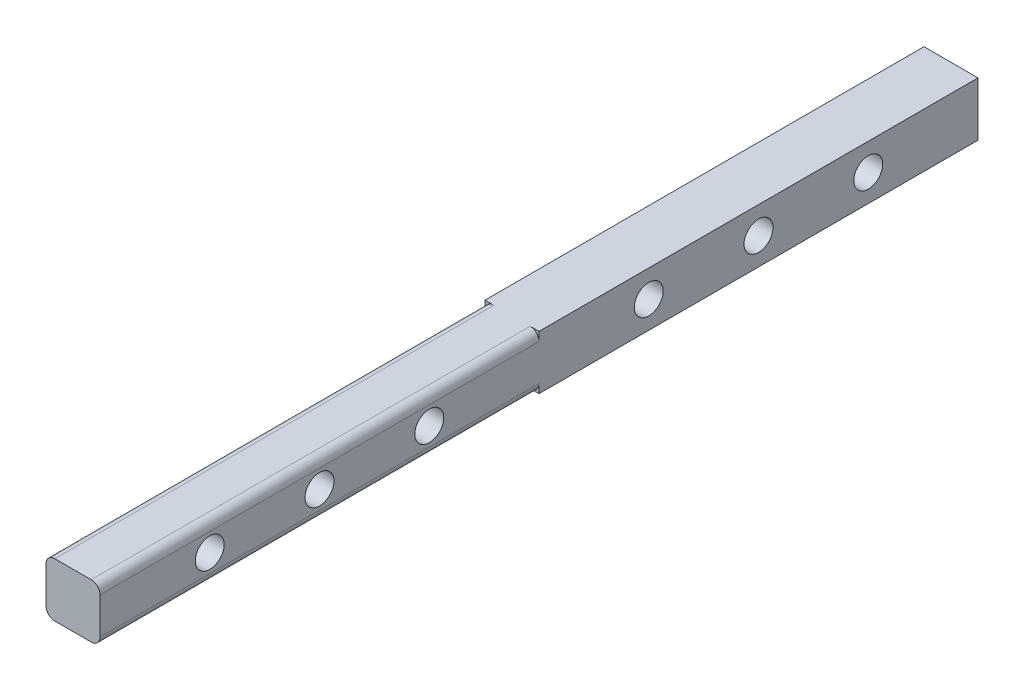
from build123d import *

# Parameters (mm, degrees)
SKETCH_1_W          = 6.15
SKETCH_1_H          = 6.15
EXTRUDE_1_DEPTH     = 50
FILLET_1_R          = 1
SKETCH_1_2_W        = 6.15
SKETCH_1_2_H        = 6.15
EXTRUDE_2_DEPTH     = 50
SKETCH_2_R          = 1.65
CUT_EXTRUDE_1_DEPTH = 51.470566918


with BuildPart() as part:
    # Sketch 1 → Extrude 1 (new body)
    with BuildSketch(Plane.XY):
        Rectangle(SKETCH_1_W, SKETCH_1_H)
    extrude(amount=EXTRUDE_1_DEPTH)

    # Fillet 1
    fillet_1_edges = [part.edges().sort_by_distance(p)[0] for p in [
        (3.075, -3.075, 25),
        (-3.075, -3.075, 25),
        (-3.075, 3.075, 25),
        (3.075, 3.075, 25),
    ]]
    fillet(fillet_1_edges, radius=FILLET_1_R)

    # Sketch 1_2 → Extrude 2 (add)
    with BuildSketch(Plane.XY):
        Rectangle(SKETCH_1_2_W, SKETCH_1_2_H)
    extrude(amount=-EXTRUDE_2_DEPTH)

    # Sketch 2 → Cut-Extrude 1 (cut, through all)
    with BuildSketch(Plane(origin=(3.075, 0, 0), x_dir=(0, 0, -1), z_dir=(1, 0, 0))):
        with Locations((-37.5, 0)):
            Circle(SKETCH_2_R)
        with Locations((-25, 0)):
            Circle(SKETCH_2_R)
        with Locations((-12.5, 0)):
            Circle(SKETCH_2_R)
        with Locations((12.5, 0)):
            Circle(SKETCH_2_R)
        with Locations((25, 0)):
            Circle(SKETCH_2_R)
        with Locations((37.5, 0)):
            Circle(SKETCH_2_R)
    extrude(amount=-CUT_EXTRUDE_1_DEPTH, mode=Mode.SUBTRACT)


solid = part.part
